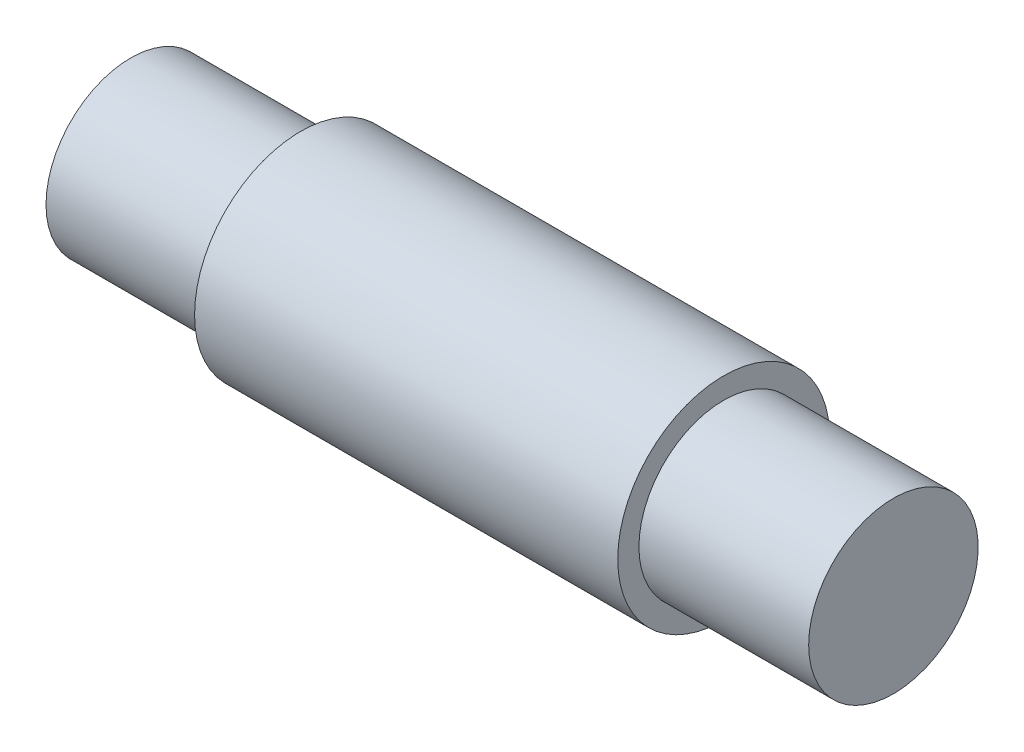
ISO-10303-21;
HEADER;
FILE_DESCRIPTION(('STEP AP214'),'2;1');
FILE_NAME('part.step','',(''),(''),'','','');
FILE_SCHEMA(('AUTOMOTIVE_DESIGN { 1 0 10303 214 1 1 1 1 }'));
ENDSEC;
DATA;
#1=APPLICATION_CONTEXT('core data for automotive mechanical design processes');
#2=APPLICATION_PROTOCOL_DEFINITION('international standard','automotive_design',2000,#1);
#3=PRODUCT_CONTEXT('',#1,'mechanical');
#4=PRODUCT('Part','Part','',(#3));
#5=PRODUCT_RELATED_PRODUCT_CATEGORY('part','',(#4));
#6=PRODUCT_DEFINITION_FORMATION('','',#4);
#7=PRODUCT_DEFINITION_CONTEXT('part definition',#1,'design');
#8=PRODUCT_DEFINITION('design','',#6,#7);
#9=PRODUCT_DEFINITION_SHAPE('','',#8);
#10=(LENGTH_UNIT() NAMED_UNIT(*) SI_UNIT(.MILLI.,.METRE.));
#11=(NAMED_UNIT(*) PLANE_ANGLE_UNIT() SI_UNIT($,.RADIAN.));
#12=(NAMED_UNIT(*) SI_UNIT($,.STERADIAN.) SOLID_ANGLE_UNIT());
#13=UNCERTAINTY_MEASURE_WITH_UNIT(LENGTH_MEASURE(1.E-05),#10,'distance_accuracy_value','');
#14=(GEOMETRIC_REPRESENTATION_CONTEXT(3) GLOBAL_UNCERTAINTY_ASSIGNED_CONTEXT((#13)) GLOBAL_UNIT_ASSIGNED_CONTEXT((#10,
#11,#12)) REPRESENTATION_CONTEXT('',''));
#15=CARTESIAN_POINT('',(0.,0.,0.));
#16=DIRECTION('',(0.,0.,1.));
#17=DIRECTION('',(1.,0.,0.));
#18=AXIS2_PLACEMENT_3D('',#15,#16,#17);
#19=CARTESIAN_POINT('',(-14.2875,0.,0.));
#20=DIRECTION('',(1.,0.,0.));
#21=DIRECTION('',(0.,0.,-1.));
#22=AXIS2_PLACEMENT_3D('',#19,#20,#21);
#23=PLANE('',#22);
#24=CARTESIAN_POINT('',(-14.2875,0.,0.));
#25=DIRECTION('',(-1.,0.,0.));
#26=DIRECTION('',(0.,0.,1.));
#27=AXIS2_PLACEMENT_3D('',#24,#25,#26);
#28=CIRCLE('',#27,3.175);
#29=CARTESIAN_POINT('',(-14.2875,0.,3.175));
#30=VERTEX_POINT('',#29);
#31=EDGE_CURVE('E10',#30,#30,#28,.T.);
#32=ORIENTED_EDGE('',*,*,#31,.T.);
#33=EDGE_LOOP('',(#32));
#34=FACE_BOUND('',#33,.T.);
#35=ADVANCED_FACE('F41',(#34),#23,.F.);
#36=CARTESIAN_POINT('',(-76.4564887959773,0.,0.));
#37=DIRECTION('',(-1.,0.,0.));
#38=DIRECTION('',(0.,0.,1.));
#39=AXIS2_PLACEMENT_3D('',#36,#37,#38);
#40=CYLINDRICAL_SURFACE('',#39,3.175);
#41=ORIENTED_EDGE('',*,*,#31,.F.);
#42=EDGE_LOOP('',(#41));
#43=FACE_BOUND('',#42,.T.);
#44=CARTESIAN_POINT('',(-7.9275,0.,0.));
#45=DIRECTION('',(-1.,0.,0.));
#46=DIRECTION('',(0.,0.,1.));
#47=AXIS2_PLACEMENT_3D('',#44,#45,#46);
#48=CIRCLE('',#47,3.175);
#49=CARTESIAN_POINT('',(-7.9275,0.,3.175));
#50=VERTEX_POINT('',#49);
#51=EDGE_CURVE('E47',#50,#50,#48,.T.);
#52=ORIENTED_EDGE('',*,*,#51,.T.);
#53=EDGE_LOOP('',(#52));
#54=FACE_BOUND('',#53,.T.);
#55=ADVANCED_FACE('F79',(#43,#54),#40,.T.);
#56=CARTESIAN_POINT('',(-7.9275,3.175,0.));
#57=DIRECTION('',(1.,0.,0.));
#58=DIRECTION('',(0.,0.,-1.));
#59=AXIS2_PLACEMENT_3D('',#56,#57,#58);
#60=PLANE('',#59);
#61=ORIENTED_EDGE('',*,*,#51,.F.);
#62=EDGE_LOOP('',(#61));
#63=FACE_BOUND('',#62,.T.);
#64=CARTESIAN_POINT('',(-7.9275,0.,0.));
#65=DIRECTION('',(-1.,0.,0.));
#66=DIRECTION('',(0.,0.,1.));
#67=AXIS2_PLACEMENT_3D('',#64,#65,#66);
#68=CIRCLE('',#67,3.96875);
#69=CARTESIAN_POINT('',(-7.9275,0.,3.96875));
#70=VERTEX_POINT('',#69);
#71=EDGE_CURVE('E51',#70,#70,#68,.T.);
#72=ORIENTED_EDGE('',*,*,#71,.T.);
#73=EDGE_LOOP('',(#72));
#74=FACE_BOUND('',#73,.T.);
#75=ADVANCED_FACE('F83',(#63,#74),#60,.F.);
#76=CARTESIAN_POINT('',(-76.4564887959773,0.,0.));
#77=DIRECTION('',(-1.,0.,0.));
#78=DIRECTION('',(0.,0.,1.));
#79=AXIS2_PLACEMENT_3D('',#76,#77,#78);
#80=CYLINDRICAL_SURFACE('',#79,3.96875);
#81=ORIENTED_EDGE('',*,*,#71,.F.);
#82=EDGE_LOOP('',(#81));
#83=FACE_BOUND('',#82,.T.);
#84=CARTESIAN_POINT('',(7.9275,0.,0.));
#85=DIRECTION('',(-1.,0.,0.));
#86=DIRECTION('',(0.,0.,1.));
#87=AXIS2_PLACEMENT_3D('',#84,#85,#86);
#88=CIRCLE('',#87,3.96875);
#89=CARTESIAN_POINT('',(7.9275,0.,3.96875));
#90=VERTEX_POINT('',#89);
#91=EDGE_CURVE('E55',#90,#90,#88,.T.);
#92=ORIENTED_EDGE('',*,*,#91,.T.);
#93=EDGE_LOOP('',(#92));
#94=FACE_BOUND('',#93,.T.);
#95=ADVANCED_FACE('F88',(#83,#94),#80,.T.);
#96=CARTESIAN_POINT('',(7.9275,3.96875,0.));
#97=DIRECTION('',(-1.,0.,0.));
#98=DIRECTION('',(0.,0.,1.));
#99=AXIS2_PLACEMENT_3D('',#96,#97,#98);
#100=PLANE('',#99);
#101=ORIENTED_EDGE('',*,*,#91,.F.);
#102=EDGE_LOOP('',(#101));
#103=FACE_BOUND('',#102,.T.);
#104=CARTESIAN_POINT('',(7.9275,0.,0.));
#105=DIRECTION('',(-1.,0.,0.));
#106=DIRECTION('',(0.,0.,1.));
#107=AXIS2_PLACEMENT_3D('',#104,#105,#106);
#108=CIRCLE('',#107,3.175);
#109=CARTESIAN_POINT('',(7.9275,0.,3.175));
#110=VERTEX_POINT('',#109);
#111=EDGE_CURVE('E60',#110,#110,#108,.T.);
#112=ORIENTED_EDGE('',*,*,#111,.T.);
#113=EDGE_LOOP('',(#112));
#114=FACE_BOUND('',#113,.T.);
#115=ADVANCED_FACE('F75',(#103,#114),#100,.F.);
#116=CARTESIAN_POINT('',(-76.4564887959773,0.,0.));
#117=DIRECTION('',(-1.,0.,0.));
#118=DIRECTION('',(0.,0.,1.));
#119=AXIS2_PLACEMENT_3D('',#116,#117,#118);
#120=CYLINDRICAL_SURFACE('',#119,3.175);
#121=ORIENTED_EDGE('',*,*,#111,.F.);
#122=EDGE_LOOP('',(#121));
#123=FACE_BOUND('',#122,.T.);
#124=CARTESIAN_POINT('',(14.2875,0.,0.));
#125=DIRECTION('',(-1.,0.,0.));
#126=DIRECTION('',(0.,0.,1.));
#127=AXIS2_PLACEMENT_3D('',#124,#125,#126);
#128=CIRCLE('',#127,3.175);
#129=CARTESIAN_POINT('',(14.2875,0.,3.175));
#130=VERTEX_POINT('',#129);
#131=EDGE_CURVE('E63',#130,#130,#128,.T.);
#132=ORIENTED_EDGE('',*,*,#131,.T.);
#133=EDGE_LOOP('',(#132));
#134=FACE_BOUND('',#133,.T.);
#135=ADVANCED_FACE('F67',(#123,#134),#120,.T.);
#136=CARTESIAN_POINT('',(14.2875,3.175,0.));
#137=DIRECTION('',(-1.,0.,0.));
#138=DIRECTION('',(0.,0.,1.));
#139=AXIS2_PLACEMENT_3D('',#136,#137,#138);
#140=PLANE('',#139);
#141=ORIENTED_EDGE('',*,*,#131,.F.);
#142=EDGE_LOOP('',(#141));
#143=FACE_BOUND('',#142,.T.);
#144=ADVANCED_FACE('F69',(#143),#140,.F.);
#145=CLOSED_SHELL('',(#35,#55,#75,#95,#115,#135,#144));
#146=MANIFOLD_SOLID_BREP('B2',#145);
#147=ADVANCED_BREP_SHAPE_REPRESENTATION('',(#18,#146),#14);
#148=SHAPE_DEFINITION_REPRESENTATION(#9,#147);
ENDSEC;
END-ISO-10303-21;
